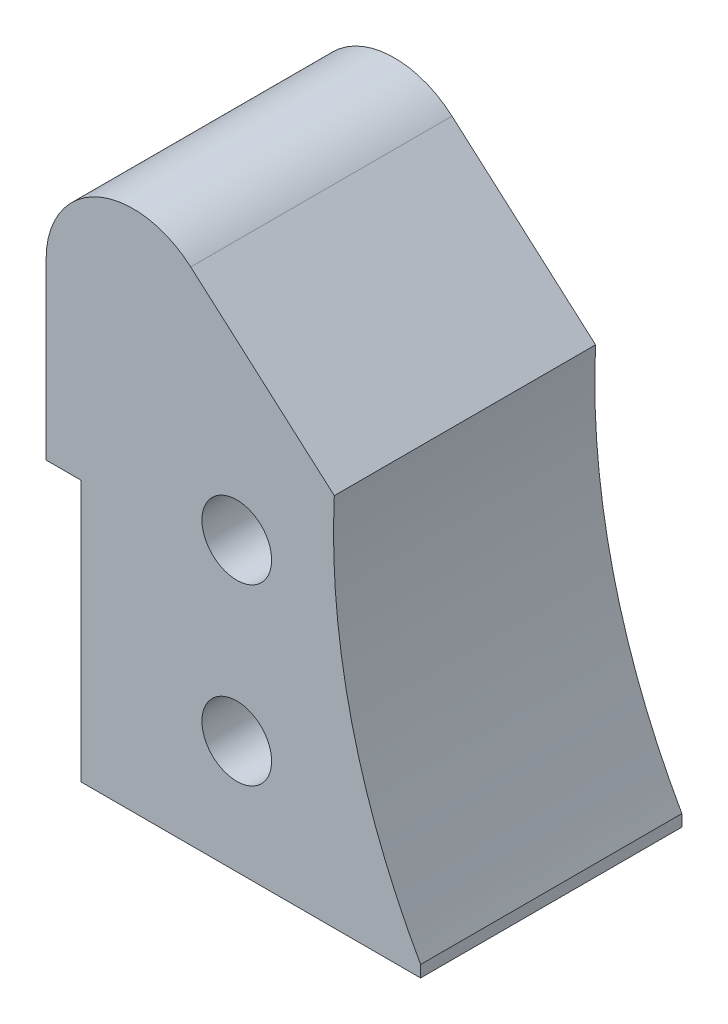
ISO-10303-21;
HEADER;
FILE_DESCRIPTION(('STEP AP214'),'2;1');
FILE_NAME('part.step','',(''),(''),'','','');
FILE_SCHEMA(('AUTOMOTIVE_DESIGN { 1 0 10303 214 1 1 1 1 }'));
ENDSEC;
DATA;
#1=APPLICATION_CONTEXT('core data for automotive mechanical design processes');
#2=APPLICATION_PROTOCOL_DEFINITION('international standard','automotive_design',2000,#1);
#3=PRODUCT_CONTEXT('',#1,'mechanical');
#4=PRODUCT('Part','Part','',(#3));
#5=PRODUCT_RELATED_PRODUCT_CATEGORY('part','',(#4));
#6=PRODUCT_DEFINITION_FORMATION('','',#4);
#7=PRODUCT_DEFINITION_CONTEXT('part definition',#1,'design');
#8=PRODUCT_DEFINITION('design','',#6,#7);
#9=PRODUCT_DEFINITION_SHAPE('','',#8);
#10=(LENGTH_UNIT() NAMED_UNIT(*) SI_UNIT(.MILLI.,.METRE.));
#11=(NAMED_UNIT(*) PLANE_ANGLE_UNIT() SI_UNIT($,.RADIAN.));
#12=(NAMED_UNIT(*) SI_UNIT($,.STERADIAN.) SOLID_ANGLE_UNIT());
#13=UNCERTAINTY_MEASURE_WITH_UNIT(LENGTH_MEASURE(1.E-05),#10,'distance_accuracy_value','');
#14=(GEOMETRIC_REPRESENTATION_CONTEXT(3) GLOBAL_UNCERTAINTY_ASSIGNED_CONTEXT((#13)) GLOBAL_UNIT_ASSIGNED_CONTEXT((#10,
#11,#12)) REPRESENTATION_CONTEXT('',''));
#15=CARTESIAN_POINT('',(0.,0.,0.));
#16=DIRECTION('',(0.,0.,1.));
#17=DIRECTION('',(1.,0.,0.));
#18=AXIS2_PLACEMENT_3D('',#15,#16,#17);
#19=CARTESIAN_POINT('',(-50.,5.35267143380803,-78.));
#20=DIRECTION('',(0.,0.,-1.));
#21=DIRECTION('',(0.,-1.,0.));
#22=AXIS2_PLACEMENT_3D('',#19,#20,#21);
#23=PLANE('',#22);
#24=CARTESIAN_POINT('',(-44.0547008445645,-3.14732856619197,-78.));
#25=DIRECTION('',(0.,0.,-1.));
#26=DIRECTION('',(-1.,0.,0.));
#27=AXIS2_PLACEMENT_3D('',#24,#25,#26);
#28=CIRCLE('',#27,2.);
#29=CARTESIAN_POINT('',(-46.0547008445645,-3.14732856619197,-78.));
#30=VERTEX_POINT('',#29);
#31=EDGE_CURVE('E224',#30,#30,#28,.T.);
#32=ORIENTED_EDGE('',*,*,#31,.T.);
#33=EDGE_LOOP('',(#32));
#34=FACE_BOUND('',#33,.T.);
#35=CARTESIAN_POINT('',(-44.0547008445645,-13.147328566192,-78.));
#36=DIRECTION('',(0.,0.,-1.));
#37=DIRECTION('',(-1.,0.,0.));
#38=AXIS2_PLACEMENT_3D('',#35,#36,#37);
#39=CIRCLE('',#38,2.);
#40=CARTESIAN_POINT('',(-46.0547008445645,-13.147328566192,-78.));
#41=VERTEX_POINT('',#40);
#42=EDGE_CURVE('E235',#41,#41,#39,.T.);
#43=ORIENTED_EDGE('',*,*,#42,.T.);
#44=EDGE_LOOP('',(#43));
#45=FACE_BOUND('',#44,.T.);
#46=DIRECTION('',(-1.,0.,0.));
#47=VECTOR('',#46,1.);
#48=CARTESIAN_POINT('',(-33.5,-19.647328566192,-78.));
#49=LINE('',#48,#47);
#50=CARTESIAN_POINT('',(-33.5,-19.647328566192,-78.));
#51=VERTEX_POINT('',#50);
#52=CARTESIAN_POINT('',(-53.,-19.647328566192,-78.));
#53=VERTEX_POINT('',#52);
#54=EDGE_CURVE('E11',#51,#53,#49,.T.);
#55=ORIENTED_EDGE('',*,*,#54,.F.);
#56=DIRECTION('',(0.,-1.,0.));
#57=VECTOR('',#56,1.);
#58=CARTESIAN_POINT('',(-33.5,-18.9736659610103,-78.));
#59=LINE('',#58,#57);
#60=CARTESIAN_POINT('',(-33.5,-18.9736659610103,-78.));
#61=VERTEX_POINT('',#60);
#62=EDGE_CURVE('E104',#61,#51,#59,.T.);
#63=ORIENTED_EDGE('',*,*,#62,.F.);
#64=CARTESIAN_POINT('',(0.,0.,-78.));
#65=DIRECTION('',(0.,0.,1.));
#66=DIRECTION('',(-1.,0.,0.));
#67=AXIS2_PLACEMENT_3D('',#64,#65,#66);
#68=CIRCLE('',#67,38.5);
#69=CARTESIAN_POINT('',(-38.4551322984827,1.8581711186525,-78.));
#70=VERTEX_POINT('',#69);
#71=EDGE_CURVE('E107',#70,#61,#68,.T.);
#72=ORIENTED_EDGE('',*,*,#71,.F.);
#73=DIRECTION('',(0.750923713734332,-0.660388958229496,0.));
#74=VECTOR('',#73,1.);
#75=CARTESIAN_POINT('',(-46.6980552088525,9.10729000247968,-78.));
#76=LINE('',#75,#74);
#77=CARTESIAN_POINT('',(-46.6980552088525,9.10729000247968,-78.));
#78=VERTEX_POINT('',#77);
#79=EDGE_CURVE('E196',#78,#70,#76,.T.);
#80=ORIENTED_EDGE('',*,*,#79,.F.);
#81=CARTESIAN_POINT('',(-50.,5.35267143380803,-78.));
#82=DIRECTION('',(0.,0.,-1.));
#83=DIRECTION('',(-1.,0.,0.));
#84=AXIS2_PLACEMENT_3D('',#81,#82,#83);
#85=CIRCLE('',#84,5.);
#86=CARTESIAN_POINT('',(-55.,5.35267143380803,-78.));
#87=VERTEX_POINT('',#86);
#88=EDGE_CURVE('E178',#87,#78,#85,.T.);
#89=ORIENTED_EDGE('',*,*,#88,.F.);
#90=DIRECTION('',(0.,1.,0.));
#91=VECTOR('',#90,1.);
#92=CARTESIAN_POINT('',(-55.,-4.64732856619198,-78.));
#93=LINE('',#92,#91);
#94=CARTESIAN_POINT('',(-55.,-4.64732856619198,-78.));
#95=VERTEX_POINT('',#94);
#96=EDGE_CURVE('E150',#95,#87,#93,.T.);
#97=ORIENTED_EDGE('',*,*,#96,.F.);
#98=DIRECTION('',(-1.,0.,0.));
#99=VECTOR('',#98,1.);
#100=CARTESIAN_POINT('',(-53.,-4.64732856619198,-78.));
#101=LINE('',#100,#99);
#102=CARTESIAN_POINT('',(-53.,-4.64732856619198,-78.));
#103=VERTEX_POINT('',#102);
#104=EDGE_CURVE('E26',#103,#95,#101,.T.);
#105=ORIENTED_EDGE('',*,*,#104,.F.);
#106=DIRECTION('',(0.,1.,0.));
#107=VECTOR('',#106,1.);
#108=CARTESIAN_POINT('',(-53.,-19.647328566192,-78.));
#109=LINE('',#108,#107);
#110=EDGE_CURVE('E153',#53,#103,#109,.T.);
#111=ORIENTED_EDGE('',*,*,#110,.F.);
#112=EDGE_LOOP('',(#55,#63,#72,#80,#89,#97,#105,#111));
#113=FACE_BOUND('',#112,.T.);
#114=ADVANCED_FACE('F17',(#34,#45,#113),#23,.F.);
#115=CARTESIAN_POINT('',(-33.5,-19.647328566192,8.00000000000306));
#116=DIRECTION('',(0.,-1.,0.));
#117=DIRECTION('',(0.,0.,-1.));
#118=AXIS2_PLACEMENT_3D('',#115,#116,#117);
#119=PLANE('',#118);
#120=ORIENTED_EDGE('',*,*,#54,.T.);
#121=DIRECTION('',(0.,0.,-1.));
#122=VECTOR('',#121,1.);
#123=CARTESIAN_POINT('',(-53.,-19.647328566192,8.00000000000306));
#124=LINE('',#123,#122);
#125=CARTESIAN_POINT('',(-53.,-19.647328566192,-93.));
#126=VERTEX_POINT('',#125);
#127=EDGE_CURVE('E166',#53,#126,#124,.T.);
#128=ORIENTED_EDGE('',*,*,#127,.T.);
#129=DIRECTION('',(-1.,0.,0.));
#130=VECTOR('',#129,1.);
#131=CARTESIAN_POINT('',(0.,-19.647328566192,-93.));
#132=LINE('',#131,#130);
#133=CARTESIAN_POINT('',(-33.5,-19.647328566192,-93.));
#134=VERTEX_POINT('',#133);
#135=EDGE_CURVE('E112',#134,#126,#132,.T.);
#136=ORIENTED_EDGE('',*,*,#135,.F.);
#137=DIRECTION('',(0.,0.,-1.));
#138=VECTOR('',#137,1.);
#139=CARTESIAN_POINT('',(-33.5,-19.647328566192,8.00000000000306));
#140=LINE('',#139,#138);
#141=EDGE_CURVE('E111',#51,#134,#140,.T.);
#142=ORIENTED_EDGE('',*,*,#141,.F.);
#143=EDGE_LOOP('',(#120,#128,#136,#142));
#144=FACE_BOUND('',#143,.T.);
#145=ADVANCED_FACE('F19',(#144),#119,.T.);
#146=CARTESIAN_POINT('',(-53.,-4.64732856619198,8.00000000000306));
#147=DIRECTION('',(0.,-1.,0.));
#148=DIRECTION('',(0.,0.,-1.));
#149=AXIS2_PLACEMENT_3D('',#146,#147,#148);
#150=PLANE('',#149);
#151=ORIENTED_EDGE('',*,*,#104,.T.);
#152=DIRECTION('',(0.,0.,-1.));
#153=VECTOR('',#152,1.);
#154=CARTESIAN_POINT('',(-55.,-4.64732856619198,8.00000000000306));
#155=LINE('',#154,#153);
#156=CARTESIAN_POINT('',(-55.,-4.64732856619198,-93.));
#157=VERTEX_POINT('',#156);
#158=EDGE_CURVE('E154',#95,#157,#155,.T.);
#159=ORIENTED_EDGE('',*,*,#158,.T.);
#160=DIRECTION('',(-1.,0.,0.));
#161=VECTOR('',#160,1.);
#162=CARTESIAN_POINT('',(0.,-4.64732856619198,-93.));
#163=LINE('',#162,#161);
#164=CARTESIAN_POINT('',(-53.,-4.64732856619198,-93.));
#165=VERTEX_POINT('',#164);
#166=EDGE_CURVE('E145',#165,#157,#163,.T.);
#167=ORIENTED_EDGE('',*,*,#166,.F.);
#168=DIRECTION('',(0.,0.,-1.));
#169=VECTOR('',#168,1.);
#170=CARTESIAN_POINT('',(-53.,-4.64732856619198,8.00000000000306));
#171=LINE('',#170,#169);
#172=EDGE_CURVE('E163',#103,#165,#171,.T.);
#173=ORIENTED_EDGE('',*,*,#172,.F.);
#174=EDGE_LOOP('',(#151,#159,#167,#173));
#175=FACE_BOUND('',#174,.T.);
#176=ADVANCED_FACE('F172',(#175),#150,.T.);
#177=CARTESIAN_POINT('',(-53.,-19.647328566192,8.00000000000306));
#178=DIRECTION('',(-1.,0.,0.));
#179=DIRECTION('',(0.,0.,1.));
#180=AXIS2_PLACEMENT_3D('',#177,#178,#179);
#181=PLANE('',#180);
#182=ORIENTED_EDGE('',*,*,#110,.T.);
#183=ORIENTED_EDGE('',*,*,#172,.T.);
#184=DIRECTION('',(0.,1.,0.));
#185=VECTOR('',#184,1.);
#186=CARTESIAN_POINT('',(-53.,0.,-93.));
#187=LINE('',#186,#185);
#188=EDGE_CURVE('E141',#126,#165,#187,.T.);
#189=ORIENTED_EDGE('',*,*,#188,.F.);
#190=ORIENTED_EDGE('',*,*,#127,.F.);
#191=EDGE_LOOP('',(#182,#183,#189,#190));
#192=FACE_BOUND('',#191,.T.);
#193=ADVANCED_FACE('F267',(#192),#181,.T.);
#194=CARTESIAN_POINT('',(-55.,16.4083148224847,8.));
#195=DIRECTION('',(1.,0.,0.));
#196=DIRECTION('',(0.,1.,0.));
#197=AXIS2_PLACEMENT_3D('',#194,#195,#196);
#198=PLANE('',#197);
#199=ORIENTED_EDGE('',*,*,#158,.F.);
#200=ORIENTED_EDGE('',*,*,#96,.T.);
#201=DIRECTION('',(0.,0.,-1.));
#202=VECTOR('',#201,1.);
#203=CARTESIAN_POINT('',(-55.,5.35267143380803,8.));
#204=LINE('',#203,#202);
#205=CARTESIAN_POINT('',(-55.,5.35267143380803,-93.));
#206=VERTEX_POINT('',#205);
#207=EDGE_CURVE('E193',#87,#206,#204,.T.);
#208=ORIENTED_EDGE('',*,*,#207,.T.);
#209=DIRECTION('',(0.,1.,0.));
#210=VECTOR('',#209,1.);
#211=CARTESIAN_POINT('',(-55.,0.,-93.));
#212=LINE('',#211,#210);
#213=EDGE_CURVE('E149',#157,#206,#212,.T.);
#214=ORIENTED_EDGE('',*,*,#213,.F.);
#215=EDGE_LOOP('',(#199,#200,#208,#214));
#216=FACE_BOUND('',#215,.T.);
#217=ADVANCED_FACE('F182',(#216),#198,.F.);
#218=CARTESIAN_POINT('',(-33.5,0.,-108.));
#219=DIRECTION('',(1.,0.,0.));
#220=DIRECTION('',(0.,1.,0.));
#221=AXIS2_PLACEMENT_3D('',#218,#219,#220);
#222=PLANE('',#221);
#223=ORIENTED_EDGE('',*,*,#62,.T.);
#224=ORIENTED_EDGE('',*,*,#141,.T.);
#225=DIRECTION('',(0.,-1.,0.));
#226=VECTOR('',#225,1.);
#227=CARTESIAN_POINT('',(-33.5,0.,-93.));
#228=LINE('',#227,#226);
#229=CARTESIAN_POINT('',(-33.5,-18.9736659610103,-93.));
#230=VERTEX_POINT('',#229);
#231=EDGE_CURVE('E118',#230,#134,#228,.T.);
#232=ORIENTED_EDGE('',*,*,#231,.F.);
#233=DIRECTION('',(0.,0.,1.));
#234=VECTOR('',#233,1.);
#235=CARTESIAN_POINT('',(-33.5,-18.9736659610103,-108.));
#236=LINE('',#235,#234);
#237=EDGE_CURVE('E115',#230,#61,#236,.T.);
#238=ORIENTED_EDGE('',*,*,#237,.T.);
#239=EDGE_LOOP('',(#223,#224,#232,#238));
#240=FACE_BOUND('',#239,.T.);
#241=ADVANCED_FACE('F116',(#240),#222,.T.);
#242=CARTESIAN_POINT('',(0.,0.,-93.));
#243=DIRECTION('',(0.,0.,-1.));
#244=DIRECTION('',(0.,-1.,0.));
#245=AXIS2_PLACEMENT_3D('',#242,#243,#244);
#246=PLANE('',#245);
#247=CARTESIAN_POINT('',(-44.0547008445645,-3.14732856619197,-93.));
#248=DIRECTION('',(0.,0.,-1.));
#249=DIRECTION('',(-1.,0.,0.));
#250=AXIS2_PLACEMENT_3D('',#247,#248,#249);
#251=CIRCLE('',#250,2.);
#252=CARTESIAN_POINT('',(-46.0547008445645,-3.14732856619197,-93.));
#253=VERTEX_POINT('',#252);
#254=EDGE_CURVE('E218',#253,#253,#251,.T.);
#255=ORIENTED_EDGE('',*,*,#254,.F.);
#256=EDGE_LOOP('',(#255));
#257=FACE_BOUND('',#256,.T.);
#258=CARTESIAN_POINT('',(-44.0547008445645,-13.147328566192,-93.));
#259=DIRECTION('',(0.,0.,-1.));
#260=DIRECTION('',(-1.,0.,0.));
#261=AXIS2_PLACEMENT_3D('',#258,#259,#260);
#262=CIRCLE('',#261,2.);
#263=CARTESIAN_POINT('',(-46.0547008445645,-13.147328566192,-93.));
#264=VERTEX_POINT('',#263);
#265=EDGE_CURVE('E232',#264,#264,#262,.T.);
#266=ORIENTED_EDGE('',*,*,#265,.F.);
#267=EDGE_LOOP('',(#266));
#268=FACE_BOUND('',#267,.T.);
#269=ORIENTED_EDGE('',*,*,#188,.T.);
#270=ORIENTED_EDGE('',*,*,#166,.T.);
#271=ORIENTED_EDGE('',*,*,#213,.T.);
#272=CARTESIAN_POINT('',(-50.,5.35267143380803,-93.));
#273=DIRECTION('',(0.,0.,-1.));
#274=DIRECTION('',(-1.,0.,0.));
#275=AXIS2_PLACEMENT_3D('',#272,#273,#274);
#276=CIRCLE('',#275,5.);
#277=CARTESIAN_POINT('',(-46.6980552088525,9.10729000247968,-93.));
#278=VERTEX_POINT('',#277);
#279=EDGE_CURVE('E197',#206,#278,#276,.T.);
#280=ORIENTED_EDGE('',*,*,#279,.T.);
#281=DIRECTION('',(0.750923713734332,-0.660388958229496,0.));
#282=VECTOR('',#281,1.);
#283=CARTESIAN_POINT('',(-15.8493349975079,-18.022169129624,-93.));
#284=LINE('',#283,#282);
#285=CARTESIAN_POINT('',(-38.4551322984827,1.8581711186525,-93.));
#286=VERTEX_POINT('',#285);
#287=EDGE_CURVE('E129',#278,#286,#284,.T.);
#288=ORIENTED_EDGE('',*,*,#287,.T.);
#289=CARTESIAN_POINT('',(0.,0.,-93.));
#290=DIRECTION('',(0.,0.,1.));
#291=DIRECTION('',(-1.,0.,0.));
#292=AXIS2_PLACEMENT_3D('',#289,#290,#291);
#293=CIRCLE('',#292,38.5);
#294=EDGE_CURVE('E122',#286,#230,#293,.T.);
#295=ORIENTED_EDGE('',*,*,#294,.T.);
#296=ORIENTED_EDGE('',*,*,#231,.T.);
#297=ORIENTED_EDGE('',*,*,#135,.T.);
#298=EDGE_LOOP('',(#269,#270,#271,#280,#288,#295,#296,#297));
#299=FACE_BOUND('',#298,.T.);
#300=ADVANCED_FACE('F205',(#257,#268,#299),#246,.T.);
#301=CARTESIAN_POINT('',(0.,0.,-108.));
#302=DIRECTION('',(0.,0.,1.));
#303=DIRECTION('',(1.,0.,0.));
#304=AXIS2_PLACEMENT_3D('',#301,#302,#303);
#305=CYLINDRICAL_SURFACE('',#304,38.5);
#306=ORIENTED_EDGE('',*,*,#71,.T.);
#307=ORIENTED_EDGE('',*,*,#237,.F.);
#308=ORIENTED_EDGE('',*,*,#294,.F.);
#309=DIRECTION('',(0.,0.,1.));
#310=VECTOR('',#309,1.);
#311=CARTESIAN_POINT('',(-38.4551322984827,1.8581711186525,-108.));
#312=LINE('',#311,#310);
#313=EDGE_CURVE('E126',#286,#70,#312,.T.);
#314=ORIENTED_EDGE('',*,*,#313,.T.);
#315=EDGE_LOOP('',(#306,#307,#308,#314));
#316=FACE_BOUND('',#315,.T.);
#317=ADVANCED_FACE('F124',(#316),#305,.F.);
#318=CARTESIAN_POINT('',(-15.8493349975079,-18.022169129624,2.));
#319=DIRECTION('',(-0.660388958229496,-0.750923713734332,0.));
#320=DIRECTION('',(-0.750923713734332,0.660388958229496,0.));
#321=AXIS2_PLACEMENT_3D('',#318,#319,#320);
#322=PLANE('',#321);
#323=DIRECTION('',(0.,0.,1.));
#324=VECTOR('',#323,1.);
#325=CARTESIAN_POINT('',(-46.6980552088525,9.10729000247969,2.));
#326=LINE('',#325,#324);
#327=EDGE_CURVE('E190',#278,#78,#326,.T.);
#328=ORIENTED_EDGE('',*,*,#327,.T.);
#329=ORIENTED_EDGE('',*,*,#79,.T.);
#330=ORIENTED_EDGE('',*,*,#313,.F.);
#331=ORIENTED_EDGE('',*,*,#287,.F.);
#332=EDGE_LOOP('',(#328,#329,#330,#331));
#333=FACE_BOUND('',#332,.T.);
#334=ADVANCED_FACE('F213',(#333),#322,.F.);
#335=CARTESIAN_POINT('',(-50.,5.35267143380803,8.));
#336=DIRECTION('',(0.,0.,-1.));
#337=DIRECTION('',(-1.,0.,0.));
#338=AXIS2_PLACEMENT_3D('',#335,#336,#337);
#339=CYLINDRICAL_SURFACE('',#338,5.);
#340=ORIENTED_EDGE('',*,*,#88,.T.);
#341=ORIENTED_EDGE('',*,*,#327,.F.);
#342=ORIENTED_EDGE('',*,*,#279,.F.);
#343=ORIENTED_EDGE('',*,*,#207,.F.);
#344=EDGE_LOOP('',(#340,#341,#342,#343));
#345=FACE_BOUND('',#344,.T.);
#346=ADVANCED_FACE('F216',(#345),#339,.T.);
#347=CARTESIAN_POINT('',(-44.0547008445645,-3.14732856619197,-88.));
#348=DIRECTION('',(0.,0.,-1.));
#349=DIRECTION('',(-1.,0.,0.));
#350=AXIS2_PLACEMENT_3D('',#347,#348,#349);
#351=CYLINDRICAL_SURFACE('',#350,2.);
#352=ORIENTED_EDGE('',*,*,#254,.T.);
#353=EDGE_LOOP('',(#352));
#354=FACE_BOUND('',#353,.T.);
#355=ORIENTED_EDGE('',*,*,#31,.F.);
#356=EDGE_LOOP('',(#355));
#357=FACE_BOUND('',#356,.T.);
#358=ADVANCED_FACE('F246',(#354,#357),#351,.F.);
#359=CARTESIAN_POINT('',(-44.0547008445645,-13.147328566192,-88.));
#360=DIRECTION('',(0.,0.,-1.));
#361=DIRECTION('',(-1.,0.,0.));
#362=AXIS2_PLACEMENT_3D('',#359,#360,#361);
#363=CYLINDRICAL_SURFACE('',#362,2.);
#364=ORIENTED_EDGE('',*,*,#265,.T.);
#365=EDGE_LOOP('',(#364));
#366=FACE_BOUND('',#365,.T.);
#367=ORIENTED_EDGE('',*,*,#42,.F.);
#368=EDGE_LOOP('',(#367));
#369=FACE_BOUND('',#368,.T.);
#370=ADVANCED_FACE('F244',(#366,#369),#363,.F.);
#371=CLOSED_SHELL('',(#114,#145,#176,#193,#217,#241,#300,#317,#334,#346,#358,#370));
#372=MANIFOLD_SOLID_BREP('B1',#371);
#373=ADVANCED_BREP_SHAPE_REPRESENTATION('',(#18,#372),#14);
#374=SHAPE_DEFINITION_REPRESENTATION(#9,#373);
ENDSEC;
END-ISO-10303-21;
